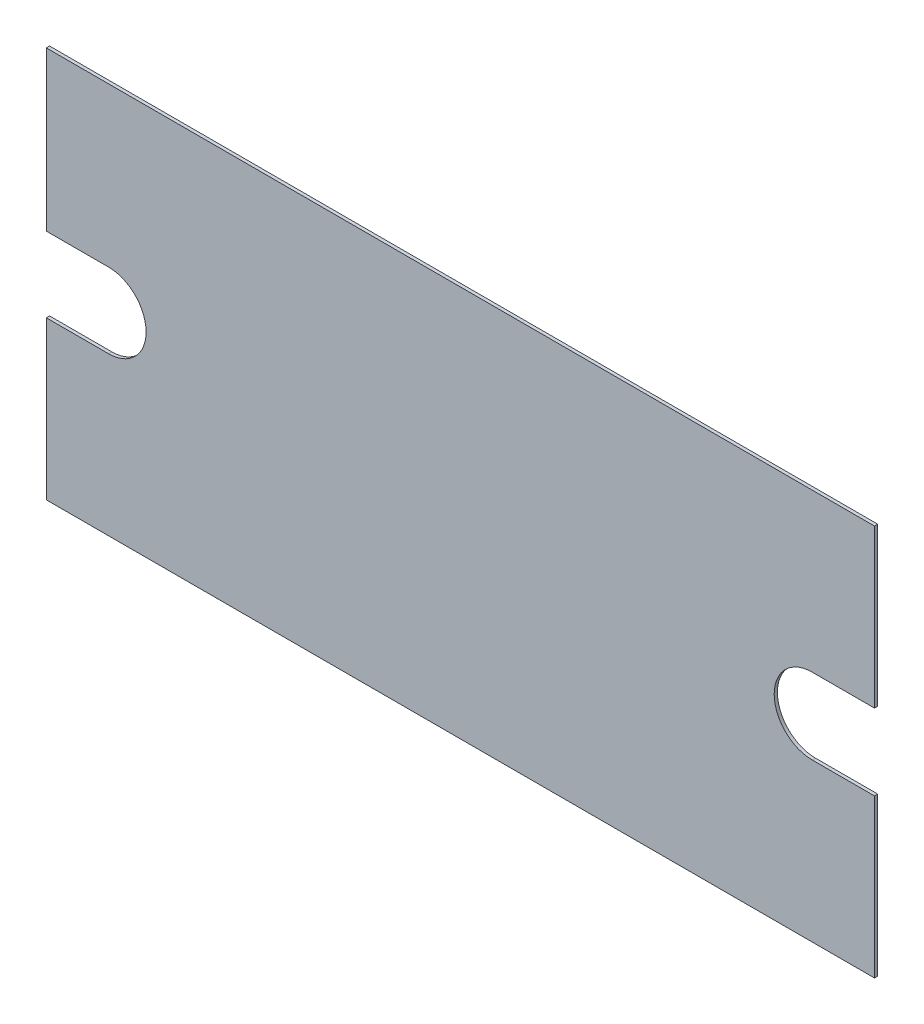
ISO-10303-21;
HEADER;
FILE_DESCRIPTION(('STEP AP214'),'2;1');
FILE_NAME('part.step','',(''),(''),'','','');
FILE_SCHEMA(('AUTOMOTIVE_DESIGN { 1 0 10303 214 1 1 1 1 }'));
ENDSEC;
DATA;
#1=APPLICATION_CONTEXT('core data for automotive mechanical design processes');
#2=APPLICATION_PROTOCOL_DEFINITION('international standard','automotive_design',2000,#1);
#3=PRODUCT_CONTEXT('',#1,'mechanical');
#4=PRODUCT('Part','Part','',(#3));
#5=PRODUCT_RELATED_PRODUCT_CATEGORY('part','',(#4));
#6=PRODUCT_DEFINITION_FORMATION('','',#4);
#7=PRODUCT_DEFINITION_CONTEXT('part definition',#1,'design');
#8=PRODUCT_DEFINITION('design','',#6,#7);
#9=PRODUCT_DEFINITION_SHAPE('','',#8);
#10=(LENGTH_UNIT() NAMED_UNIT(*) SI_UNIT(.MILLI.,.METRE.));
#11=(NAMED_UNIT(*) PLANE_ANGLE_UNIT() SI_UNIT($,.RADIAN.));
#12=(NAMED_UNIT(*) SI_UNIT($,.STERADIAN.) SOLID_ANGLE_UNIT());
#13=UNCERTAINTY_MEASURE_WITH_UNIT(LENGTH_MEASURE(1.E-05),#10,'distance_accuracy_value','');
#14=(GEOMETRIC_REPRESENTATION_CONTEXT(3) GLOBAL_UNCERTAINTY_ASSIGNED_CONTEXT((#13)) GLOBAL_UNIT_ASSIGNED_CONTEXT((#10,
#11,#12)) REPRESENTATION_CONTEXT('',''));
#15=CARTESIAN_POINT('',(0.,0.,0.));
#16=DIRECTION('',(0.,0.,1.));
#17=DIRECTION('',(1.,0.,0.));
#18=AXIS2_PLACEMENT_3D('',#15,#16,#17);
#19=CARTESIAN_POINT('',(-34.7401610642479,10.9687285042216,0.2));
#20=DIRECTION('',(1.,0.,0.));
#21=DIRECTION('',(0.,1.,0.));
#22=AXIS2_PLACEMENT_3D('',#19,#20,#21);
#23=PLANE('',#22);
#24=DIRECTION('',(0.,-1.,0.));
#25=VECTOR('',#24,1.);
#26=CARTESIAN_POINT('',(-34.7401610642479,10.9687285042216,0.));
#27=LINE('',#26,#25);
#28=CARTESIAN_POINT('',(-34.7401610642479,20.7800113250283,0.));
#29=VERTEX_POINT('',#28);
#30=CARTESIAN_POINT('',(-34.7401610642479,10.9687285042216,0.));
#31=VERTEX_POINT('',#30);
#32=EDGE_CURVE('E165',#29,#31,#27,.T.);
#33=ORIENTED_EDGE('',*,*,#32,.T.);
#34=DIRECTION('',(0.,0.,-1.));
#35=VECTOR('',#34,1.);
#36=CARTESIAN_POINT('',(-34.7401610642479,10.9687285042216,0.2));
#37=LINE('',#36,#35);
#38=CARTESIAN_POINT('',(-34.7401610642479,10.9687285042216,0.2));
#39=VERTEX_POINT('',#38);
#40=EDGE_CURVE('E49',#39,#31,#37,.T.);
#41=ORIENTED_EDGE('',*,*,#40,.F.);
#42=DIRECTION('',(0.,-1.,0.));
#43=VECTOR('',#42,1.);
#44=CARTESIAN_POINT('',(-34.7401610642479,20.7187285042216,0.2));
#45=LINE('',#44,#43);
#46=CARTESIAN_POINT('',(-34.7401610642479,20.7800113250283,0.2));
#47=VERTEX_POINT('',#46);
#48=EDGE_CURVE('E113',#47,#39,#45,.T.);
#49=ORIENTED_EDGE('',*,*,#48,.F.);
#50=DIRECTION('',(0.,0.,-1.));
#51=VECTOR('',#50,1.);
#52=CARTESIAN_POINT('',(-34.7401610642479,20.7800113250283,0.2));
#53=LINE('',#52,#51);
#54=EDGE_CURVE('E11',#47,#29,#53,.T.);
#55=ORIENTED_EDGE('',*,*,#54,.T.);
#56=EDGE_LOOP('',(#33,#41,#49,#55));
#57=FACE_BOUND('',#56,.T.);
#58=ADVANCED_FACE('F41',(#57),#23,.F.);
#59=CARTESIAN_POINT('',(-34.7401610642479,10.9687285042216,0.2));
#60=DIRECTION('',(0.,1.,0.));
#61=DIRECTION('',(-1.,0.,0.));
#62=AXIS2_PLACEMENT_3D('',#59,#60,#61);
#63=PLANE('',#62);
#64=DIRECTION('',(1.,0.,0.));
#65=VECTOR('',#64,1.);
#66=CARTESIAN_POINT('',(-34.7401610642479,10.9687285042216,0.));
#67=LINE('',#66,#65);
#68=CARTESIAN_POINT('',(-30.890161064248,10.9687285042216,0.));
#69=VERTEX_POINT('',#68);
#70=EDGE_CURVE('E167',#31,#69,#67,.T.);
#71=ORIENTED_EDGE('',*,*,#70,.T.);
#72=DIRECTION('',(0.,0.,-1.));
#73=VECTOR('',#72,1.);
#74=CARTESIAN_POINT('',(-30.890161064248,10.9687285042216,0.2));
#75=LINE('',#74,#73);
#76=CARTESIAN_POINT('',(-30.890161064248,10.9687285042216,0.2));
#77=VERTEX_POINT('',#76);
#78=EDGE_CURVE('E205',#77,#69,#75,.T.);
#79=ORIENTED_EDGE('',*,*,#78,.F.);
#80=DIRECTION('',(1.,0.,0.));
#81=VECTOR('',#80,1.);
#82=CARTESIAN_POINT('',(-34.7401610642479,10.9687285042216,0.2));
#83=LINE('',#82,#81);
#84=EDGE_CURVE('E213',#39,#77,#83,.T.);
#85=ORIENTED_EDGE('',*,*,#84,.F.);
#86=ORIENTED_EDGE('',*,*,#40,.T.);
#87=EDGE_LOOP('',(#71,#79,#85,#86));
#88=FACE_BOUND('',#87,.T.);
#89=ADVANCED_FACE('F211',(#88),#63,.F.);
#90=CARTESIAN_POINT('',(-30.890161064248,8.64936991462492,0.2));
#91=DIRECTION('',(0.,0.,-1.));
#92=DIRECTION('',(-1.,0.,0.));
#93=AXIS2_PLACEMENT_3D('',#90,#91,#92);
#94=CYLINDRICAL_SURFACE('',#93,2.31935858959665);
#95=CARTESIAN_POINT('',(-30.890161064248,8.64936991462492,0.));
#96=DIRECTION('',(0.,0.,-1.));
#97=DIRECTION('',(-1.,0.,0.));
#98=AXIS2_PLACEMENT_3D('',#95,#96,#97);
#99=CIRCLE('',#98,2.31935858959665);
#100=CARTESIAN_POINT('',(-30.890161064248,6.33001132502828,0.));
#101=VERTEX_POINT('',#100);
#102=EDGE_CURVE('E169',#69,#101,#99,.T.);
#103=ORIENTED_EDGE('',*,*,#102,.T.);
#104=DIRECTION('',(0.,0.,-1.));
#105=VECTOR('',#104,1.);
#106=CARTESIAN_POINT('',(-30.890161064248,6.33001132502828,0.2));
#107=LINE('',#106,#105);
#108=CARTESIAN_POINT('',(-30.890161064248,6.33001132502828,0.2));
#109=VERTEX_POINT('',#108);
#110=EDGE_CURVE('E202',#109,#101,#107,.T.);
#111=ORIENTED_EDGE('',*,*,#110,.F.);
#112=CARTESIAN_POINT('',(-30.890161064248,8.64936991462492,0.2));
#113=DIRECTION('',(0.,0.,-1.));
#114=DIRECTION('',(-1.,0.,0.));
#115=AXIS2_PLACEMENT_3D('',#112,#113,#114);
#116=CIRCLE('',#115,2.31935858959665);
#117=EDGE_CURVE('E231',#77,#109,#116,.T.);
#118=ORIENTED_EDGE('',*,*,#117,.F.);
#119=ORIENTED_EDGE('',*,*,#78,.T.);
#120=EDGE_LOOP('',(#103,#111,#118,#119));
#121=FACE_BOUND('',#120,.T.);
#122=ADVANCED_FACE('F222',(#121),#94,.F.);
#123=CARTESIAN_POINT('',(-34.7401610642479,6.33001132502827,0.2));
#124=DIRECTION('',(0.,-1.,0.));
#125=DIRECTION('',(1.,0.,0.));
#126=AXIS2_PLACEMENT_3D('',#123,#124,#125);
#127=PLANE('',#126);
#128=DIRECTION('',(-1.,0.,0.));
#129=VECTOR('',#128,1.);
#130=CARTESIAN_POINT('',(-34.7401610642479,6.33001132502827,0.));
#131=LINE('',#130,#129);
#132=CARTESIAN_POINT('',(-34.7401610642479,6.33001132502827,0.));
#133=VERTEX_POINT('',#132);
#134=EDGE_CURVE('E171',#101,#133,#131,.T.);
#135=ORIENTED_EDGE('',*,*,#134,.T.);
#136=DIRECTION('',(0.,0.,-1.));
#137=VECTOR('',#136,1.);
#138=CARTESIAN_POINT('',(-34.7401610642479,6.33001132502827,0.2));
#139=LINE('',#138,#137);
#140=CARTESIAN_POINT('',(-34.7401610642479,6.33001132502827,0.2));
#141=VERTEX_POINT('',#140);
#142=EDGE_CURVE('E199',#141,#133,#139,.T.);
#143=ORIENTED_EDGE('',*,*,#142,.F.);
#144=DIRECTION('',(-1.,0.,0.));
#145=VECTOR('',#144,1.);
#146=CARTESIAN_POINT('',(-34.7401610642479,6.33001132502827,0.2));
#147=LINE('',#146,#145);
#148=EDGE_CURVE('E228',#109,#141,#147,.T.);
#149=ORIENTED_EDGE('',*,*,#148,.F.);
#150=ORIENTED_EDGE('',*,*,#110,.T.);
#151=EDGE_LOOP('',(#135,#143,#149,#150));
#152=FACE_BOUND('',#151,.T.);
#153=ADVANCED_FACE('F226',(#152),#127,.F.);
#154=CARTESIAN_POINT('',(-34.7401610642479,-3.41998867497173,0.2));
#155=DIRECTION('',(1.,0.,0.));
#156=DIRECTION('',(0.,0.,-1.));
#157=AXIS2_PLACEMENT_3D('',#154,#155,#156);
#158=PLANE('',#157);
#159=DIRECTION('',(0.,-1.,0.));
#160=VECTOR('',#159,1.);
#161=CARTESIAN_POINT('',(-34.7401610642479,-3.41998867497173,0.));
#162=LINE('',#161,#160);
#163=CARTESIAN_POINT('',(-34.7401610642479,-3.41998867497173,0.));
#164=VERTEX_POINT('',#163);
#165=EDGE_CURVE('E173',#133,#164,#162,.T.);
#166=ORIENTED_EDGE('',*,*,#165,.T.);
#167=DIRECTION('',(0.,0.,-1.));
#168=VECTOR('',#167,1.);
#169=CARTESIAN_POINT('',(-34.7401610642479,-3.41998867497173,0.2));
#170=LINE('',#169,#168);
#171=CARTESIAN_POINT('',(-34.7401610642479,-3.41998867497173,0.2));
#172=VERTEX_POINT('',#171);
#173=EDGE_CURVE('E196',#172,#164,#170,.T.);
#174=ORIENTED_EDGE('',*,*,#173,.F.);
#175=DIRECTION('',(0.,-1.,0.));
#176=VECTOR('',#175,1.);
#177=CARTESIAN_POINT('',(-34.7401610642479,-3.41998867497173,0.2));
#178=LINE('',#177,#176);
#179=EDGE_CURVE('E230',#141,#172,#178,.T.);
#180=ORIENTED_EDGE('',*,*,#179,.F.);
#181=ORIENTED_EDGE('',*,*,#142,.T.);
#182=EDGE_LOOP('',(#166,#174,#180,#181));
#183=FACE_BOUND('',#182,.T.);
#184=ADVANCED_FACE('F262',(#183),#158,.F.);
#185=CARTESIAN_POINT('',(16.459838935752,-3.41998867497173,0.2));
#186=DIRECTION('',(0.,1.,0.));
#187=DIRECTION('',(-1.,0.,0.));
#188=AXIS2_PLACEMENT_3D('',#185,#186,#187);
#189=PLANE('',#188);
#190=DIRECTION('',(1.,0.,0.));
#191=VECTOR('',#190,1.);
#192=CARTESIAN_POINT('',(16.459838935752,-3.41998867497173,0.));
#193=LINE('',#192,#191);
#194=CARTESIAN_POINT('',(16.459838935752,-3.41998867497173,0.));
#195=VERTEX_POINT('',#194);
#196=EDGE_CURVE('E175',#164,#195,#193,.T.);
#197=ORIENTED_EDGE('',*,*,#196,.T.);
#198=DIRECTION('',(0.,0.,-1.));
#199=VECTOR('',#198,1.);
#200=CARTESIAN_POINT('',(16.459838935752,-3.41998867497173,0.2));
#201=LINE('',#200,#199);
#202=CARTESIAN_POINT('',(16.459838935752,-3.41998867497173,0.2));
#203=VERTEX_POINT('',#202);
#204=EDGE_CURVE('E193',#203,#195,#201,.T.);
#205=ORIENTED_EDGE('',*,*,#204,.F.);
#206=DIRECTION('',(1.,0.,0.));
#207=VECTOR('',#206,1.);
#208=CARTESIAN_POINT('',(16.459838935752,-3.41998867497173,0.2));
#209=LINE('',#208,#207);
#210=EDGE_CURVE('E233',#172,#203,#209,.T.);
#211=ORIENTED_EDGE('',*,*,#210,.F.);
#212=ORIENTED_EDGE('',*,*,#173,.T.);
#213=EDGE_LOOP('',(#197,#205,#211,#212));
#214=FACE_BOUND('',#213,.T.);
#215=ADVANCED_FACE('F265',(#214),#189,.F.);
#216=CARTESIAN_POINT('',(16.459838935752,6.33001132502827,0.2));
#217=DIRECTION('',(-1.,0.,0.));
#218=DIRECTION('',(0.,-1.,0.));
#219=AXIS2_PLACEMENT_3D('',#216,#217,#218);
#220=PLANE('',#219);
#221=DIRECTION('',(0.,1.,0.));
#222=VECTOR('',#221,1.);
#223=CARTESIAN_POINT('',(16.459838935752,6.33001132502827,0.));
#224=LINE('',#223,#222);
#225=CARTESIAN_POINT('',(16.459838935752,6.33001132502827,0.));
#226=VERTEX_POINT('',#225);
#227=EDGE_CURVE('E177',#195,#226,#224,.T.);
#228=ORIENTED_EDGE('',*,*,#227,.T.);
#229=DIRECTION('',(0.,0.,-1.));
#230=VECTOR('',#229,1.);
#231=CARTESIAN_POINT('',(16.459838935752,6.33001132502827,0.2));
#232=LINE('',#231,#230);
#233=CARTESIAN_POINT('',(16.459838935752,6.33001132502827,0.2));
#234=VERTEX_POINT('',#233);
#235=EDGE_CURVE('E190',#234,#226,#232,.T.);
#236=ORIENTED_EDGE('',*,*,#235,.F.);
#237=DIRECTION('',(0.,1.,0.));
#238=VECTOR('',#237,1.);
#239=CARTESIAN_POINT('',(16.459838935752,6.33001132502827,0.2));
#240=LINE('',#239,#238);
#241=EDGE_CURVE('E239',#203,#234,#240,.T.);
#242=ORIENTED_EDGE('',*,*,#241,.F.);
#243=ORIENTED_EDGE('',*,*,#204,.T.);
#244=EDGE_LOOP('',(#228,#236,#242,#243));
#245=FACE_BOUND('',#244,.T.);
#246=ADVANCED_FACE('F245',(#245),#220,.F.);
#247=CARTESIAN_POINT('',(16.459838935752,6.33001132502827,0.2));
#248=DIRECTION('',(0.,-1.,0.));
#249=DIRECTION('',(1.,0.,0.));
#250=AXIS2_PLACEMENT_3D('',#247,#248,#249);
#251=PLANE('',#250);
#252=DIRECTION('',(-1.,0.,0.));
#253=VECTOR('',#252,1.);
#254=CARTESIAN_POINT('',(16.459838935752,6.33001132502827,0.));
#255=LINE('',#254,#253);
#256=CARTESIAN_POINT('',(12.6098389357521,6.33001132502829,0.));
#257=VERTEX_POINT('',#256);
#258=EDGE_CURVE('E179',#226,#257,#255,.T.);
#259=ORIENTED_EDGE('',*,*,#258,.T.);
#260=DIRECTION('',(0.,0.,-1.));
#261=VECTOR('',#260,1.);
#262=CARTESIAN_POINT('',(12.6098389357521,6.33001132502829,0.2));
#263=LINE('',#262,#261);
#264=CARTESIAN_POINT('',(12.6098389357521,6.33001132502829,0.2));
#265=VERTEX_POINT('',#264);
#266=EDGE_CURVE('E154',#265,#257,#263,.T.);
#267=ORIENTED_EDGE('',*,*,#266,.F.);
#268=DIRECTION('',(-1.,0.,0.));
#269=VECTOR('',#268,1.);
#270=CARTESIAN_POINT('',(16.459838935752,6.33001132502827,0.2));
#271=LINE('',#270,#269);
#272=EDGE_CURVE('E145',#234,#265,#271,.T.);
#273=ORIENTED_EDGE('',*,*,#272,.F.);
#274=ORIENTED_EDGE('',*,*,#235,.T.);
#275=EDGE_LOOP('',(#259,#267,#273,#274));
#276=FACE_BOUND('',#275,.T.);
#277=ADVANCED_FACE('F249',(#276),#251,.F.);
#278=CARTESIAN_POINT('',(12.6098389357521,8.68001132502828,0.2));
#279=DIRECTION('',(0.,0.,-1.));
#280=DIRECTION('',(-1.,0.,0.));
#281=AXIS2_PLACEMENT_3D('',#278,#279,#280);
#282=CYLINDRICAL_SURFACE('',#281,2.34999999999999);
#283=CARTESIAN_POINT('',(12.6098389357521,8.68001132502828,0.));
#284=DIRECTION('',(0.,0.,-1.));
#285=DIRECTION('',(1.,0.,0.));
#286=AXIS2_PLACEMENT_3D('',#283,#284,#285);
#287=CIRCLE('',#286,2.34999999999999);
#288=CARTESIAN_POINT('',(12.6098389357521,11.0300113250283,0.));
#289=VERTEX_POINT('',#288);
#290=EDGE_CURVE('E153',#257,#289,#287,.T.);
#291=ORIENTED_EDGE('',*,*,#290,.T.);
#292=DIRECTION('',(0.,0.,-1.));
#293=VECTOR('',#292,1.);
#294=CARTESIAN_POINT('',(12.6098389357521,11.0300113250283,0.2));
#295=LINE('',#294,#293);
#296=CARTESIAN_POINT('',(12.6098389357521,11.0300113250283,0.2));
#297=VERTEX_POINT('',#296);
#298=EDGE_CURVE('E150',#297,#289,#295,.T.);
#299=ORIENTED_EDGE('',*,*,#298,.F.);
#300=CARTESIAN_POINT('',(12.6098389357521,8.68001132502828,0.2));
#301=DIRECTION('',(0.,0.,-1.));
#302=DIRECTION('',(1.,0.,0.));
#303=AXIS2_PLACEMENT_3D('',#300,#301,#302);
#304=CIRCLE('',#303,2.34999999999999);
#305=EDGE_CURVE('E139',#265,#297,#304,.T.);
#306=ORIENTED_EDGE('',*,*,#305,.F.);
#307=ORIENTED_EDGE('',*,*,#266,.T.);
#308=EDGE_LOOP('',(#291,#299,#306,#307));
#309=FACE_BOUND('',#308,.T.);
#310=ADVANCED_FACE('F151',(#309),#282,.F.);
#311=CARTESIAN_POINT('',(16.4598389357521,11.0300113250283,0.2));
#312=DIRECTION('',(0.,1.,0.));
#313=DIRECTION('',(-1.,0.,0.));
#314=AXIS2_PLACEMENT_3D('',#311,#312,#313);
#315=PLANE('',#314);
#316=DIRECTION('',(1.,0.,0.));
#317=VECTOR('',#316,1.);
#318=CARTESIAN_POINT('',(16.4598389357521,11.0300113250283,0.));
#319=LINE('',#318,#317);
#320=CARTESIAN_POINT('',(16.4598389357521,11.0300113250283,0.));
#321=VERTEX_POINT('',#320);
#322=EDGE_CURVE('E99',#289,#321,#319,.T.);
#323=ORIENTED_EDGE('',*,*,#322,.T.);
#324=DIRECTION('',(0.,0.,-1.));
#325=VECTOR('',#324,1.);
#326=CARTESIAN_POINT('',(16.4598389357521,11.0300113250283,0.2));
#327=LINE('',#326,#325);
#328=CARTESIAN_POINT('',(16.4598389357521,11.0300113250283,0.2));
#329=VERTEX_POINT('',#328);
#330=EDGE_CURVE('E155',#329,#321,#327,.T.);
#331=ORIENTED_EDGE('',*,*,#330,.F.);
#332=DIRECTION('',(1.,0.,0.));
#333=VECTOR('',#332,1.);
#334=CARTESIAN_POINT('',(16.4598389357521,11.0300113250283,0.2));
#335=LINE('',#334,#333);
#336=EDGE_CURVE('E143',#297,#329,#335,.T.);
#337=ORIENTED_EDGE('',*,*,#336,.F.);
#338=ORIENTED_EDGE('',*,*,#298,.T.);
#339=EDGE_LOOP('',(#323,#331,#337,#338));
#340=FACE_BOUND('',#339,.T.);
#341=ADVANCED_FACE('F157',(#340),#315,.F.);
#342=CARTESIAN_POINT('',(16.459838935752,20.7800113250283,0.2));
#343=DIRECTION('',(-1.,0.,0.));
#344=DIRECTION('',(0.,-1.,0.));
#345=AXIS2_PLACEMENT_3D('',#342,#343,#344);
#346=PLANE('',#345);
#347=DIRECTION('',(0.,1.,0.));
#348=VECTOR('',#347,1.);
#349=CARTESIAN_POINT('',(16.459838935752,20.7800113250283,0.));
#350=LINE('',#349,#348);
#351=CARTESIAN_POINT('',(16.459838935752,20.7800113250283,0.));
#352=VERTEX_POINT('',#351);
#353=EDGE_CURVE('E106',#321,#352,#350,.T.);
#354=ORIENTED_EDGE('',*,*,#353,.T.);
#355=DIRECTION('',(0.,0.,-1.));
#356=VECTOR('',#355,1.);
#357=CARTESIAN_POINT('',(16.459838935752,20.7800113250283,0.2));
#358=LINE('',#357,#356);
#359=CARTESIAN_POINT('',(16.459838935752,20.7800113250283,0.2));
#360=VERTEX_POINT('',#359);
#361=EDGE_CURVE('E161',#360,#352,#358,.T.);
#362=ORIENTED_EDGE('',*,*,#361,.F.);
#363=DIRECTION('',(0.,1.,0.));
#364=VECTOR('',#363,1.);
#365=CARTESIAN_POINT('',(16.459838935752,20.7800113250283,0.2));
#366=LINE('',#365,#364);
#367=EDGE_CURVE('E159',#329,#360,#366,.T.);
#368=ORIENTED_EDGE('',*,*,#367,.F.);
#369=ORIENTED_EDGE('',*,*,#330,.T.);
#370=EDGE_LOOP('',(#354,#362,#368,#369));
#371=FACE_BOUND('',#370,.T.);
#372=ADVANCED_FACE('F278',(#371),#346,.F.);
#373=CARTESIAN_POINT('',(-24.2674003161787,20.7800113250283,0.2));
#374=DIRECTION('',(0.,-1.,0.));
#375=DIRECTION('',(1.,0.,0.));
#376=AXIS2_PLACEMENT_3D('',#373,#374,#375);
#377=PLANE('',#376);
#378=DIRECTION('',(-1.,0.,0.));
#379=VECTOR('',#378,1.);
#380=CARTESIAN_POINT('',(-24.2674003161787,20.7800113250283,0.));
#381=LINE('',#380,#379);
#382=EDGE_CURVE('E184',#352,#29,#381,.T.);
#383=ORIENTED_EDGE('',*,*,#382,.T.);
#384=ORIENTED_EDGE('',*,*,#54,.F.);
#385=DIRECTION('',(-1.,0.,0.));
#386=VECTOR('',#385,1.);
#387=CARTESIAN_POINT('',(-24.2674003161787,20.7800113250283,0.2));
#388=LINE('',#387,#386);
#389=EDGE_CURVE('E57',#360,#47,#388,.T.);
#390=ORIENTED_EDGE('',*,*,#389,.F.);
#391=ORIENTED_EDGE('',*,*,#361,.T.);
#392=EDGE_LOOP('',(#383,#384,#390,#391));
#393=FACE_BOUND('',#392,.T.);
#394=ADVANCED_FACE('F250',(#393),#377,.F.);
#395=CARTESIAN_POINT('',(-30.890161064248,8.64936991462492,0.2));
#396=DIRECTION('',(0.,0.,-1.));
#397=DIRECTION('',(-1.,0.,0.));
#398=AXIS2_PLACEMENT_3D('',#395,#396,#397);
#399=PLANE('',#398);
#400=ORIENTED_EDGE('',*,*,#389,.T.);
#401=ORIENTED_EDGE('',*,*,#48,.T.);
#402=ORIENTED_EDGE('',*,*,#84,.T.);
#403=ORIENTED_EDGE('',*,*,#117,.T.);
#404=ORIENTED_EDGE('',*,*,#148,.T.);
#405=ORIENTED_EDGE('',*,*,#179,.T.);
#406=ORIENTED_EDGE('',*,*,#210,.T.);
#407=ORIENTED_EDGE('',*,*,#241,.T.);
#408=ORIENTED_EDGE('',*,*,#272,.T.);
#409=ORIENTED_EDGE('',*,*,#305,.T.);
#410=ORIENTED_EDGE('',*,*,#336,.T.);
#411=ORIENTED_EDGE('',*,*,#367,.T.);
#412=EDGE_LOOP('',(#400,#401,#402,#403,#404,#405,#406,#407,#408,#409,#410,#411));
#413=FACE_BOUND('',#412,.T.);
#414=ADVANCED_FACE('F141',(#413),#399,.F.);
#415=CARTESIAN_POINT('',(-30.890161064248,8.64936991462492,0.));
#416=DIRECTION('',(0.,0.,-1.));
#417=DIRECTION('',(-1.,0.,0.));
#418=AXIS2_PLACEMENT_3D('',#415,#416,#417);
#419=PLANE('',#418);
#420=ORIENTED_EDGE('',*,*,#32,.F.);
#421=ORIENTED_EDGE('',*,*,#382,.F.);
#422=ORIENTED_EDGE('',*,*,#353,.F.);
#423=ORIENTED_EDGE('',*,*,#322,.F.);
#424=ORIENTED_EDGE('',*,*,#290,.F.);
#425=ORIENTED_EDGE('',*,*,#258,.F.);
#426=ORIENTED_EDGE('',*,*,#227,.F.);
#427=ORIENTED_EDGE('',*,*,#196,.F.);
#428=ORIENTED_EDGE('',*,*,#165,.F.);
#429=ORIENTED_EDGE('',*,*,#134,.F.);
#430=ORIENTED_EDGE('',*,*,#102,.F.);
#431=ORIENTED_EDGE('',*,*,#70,.F.);
#432=EDGE_LOOP('',(#420,#421,#422,#423,#424,#425,#426,#427,#428,#429,#430,#431));
#433=FACE_BOUND('',#432,.T.);
#434=ADVANCED_FACE('F216',(#433),#419,.T.);
#435=CLOSED_SHELL('',(#58,#89,#122,#153,#184,#215,#246,#277,#310,#341,#372,#394,#414,#434));
#436=MANIFOLD_SOLID_BREP('B2',#435);
#437=ADVANCED_BREP_SHAPE_REPRESENTATION('',(#18,#436),#14);
#438=SHAPE_DEFINITION_REPRESENTATION(#9,#437);
ENDSEC;
END-ISO-10303-21;
